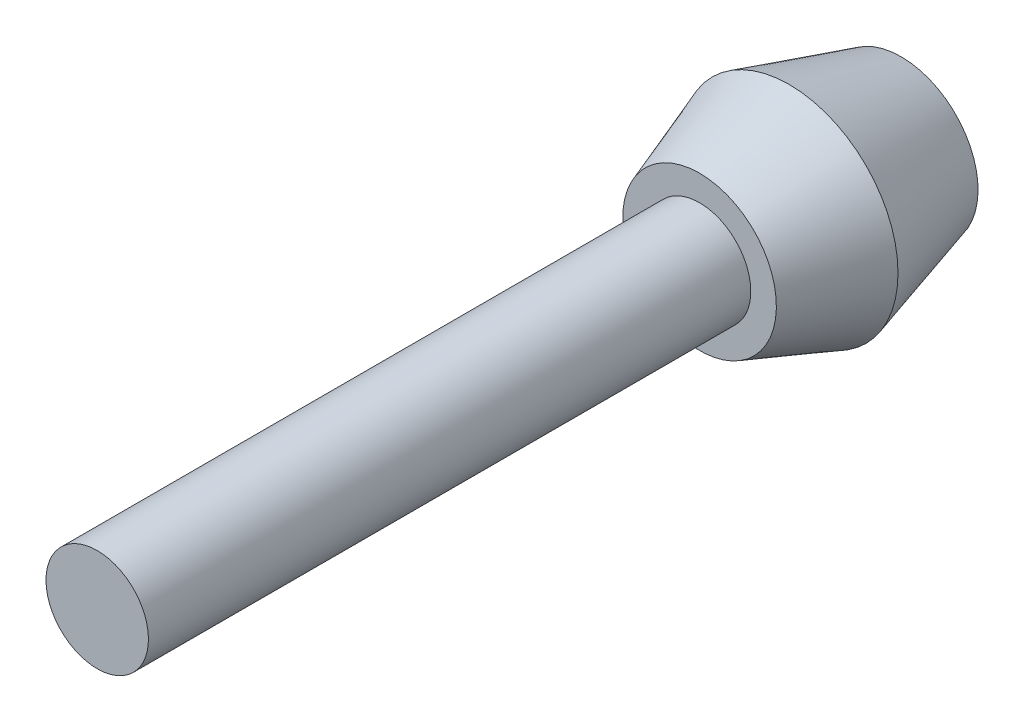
ISO-10303-21;
HEADER;
FILE_DESCRIPTION(('STEP AP214'),'2;1');
FILE_NAME('part.step','',(''),(''),'','','');
FILE_SCHEMA(('AUTOMOTIVE_DESIGN { 1 0 10303 214 1 1 1 1 }'));
ENDSEC;
DATA;
#1=APPLICATION_CONTEXT('core data for automotive mechanical design processes');
#2=APPLICATION_PROTOCOL_DEFINITION('international standard','automotive_design',2000,#1);
#3=PRODUCT_CONTEXT('',#1,'mechanical');
#4=PRODUCT('Part','Part','',(#3));
#5=PRODUCT_RELATED_PRODUCT_CATEGORY('part','',(#4));
#6=PRODUCT_DEFINITION_FORMATION('','',#4);
#7=PRODUCT_DEFINITION_CONTEXT('part definition',#1,'design');
#8=PRODUCT_DEFINITION('design','',#6,#7);
#9=PRODUCT_DEFINITION_SHAPE('','',#8);
#10=(LENGTH_UNIT() NAMED_UNIT(*) SI_UNIT(.MILLI.,.METRE.));
#11=(NAMED_UNIT(*) PLANE_ANGLE_UNIT() SI_UNIT($,.RADIAN.));
#12=(NAMED_UNIT(*) SI_UNIT($,.STERADIAN.) SOLID_ANGLE_UNIT());
#13=UNCERTAINTY_MEASURE_WITH_UNIT(LENGTH_MEASURE(1.E-05),#10,'distance_accuracy_value','');
#14=(GEOMETRIC_REPRESENTATION_CONTEXT(3) GLOBAL_UNCERTAINTY_ASSIGNED_CONTEXT((#13)) GLOBAL_UNIT_ASSIGNED_CONTEXT((#10,
#11,#12)) REPRESENTATION_CONTEXT('',''));
#15=CARTESIAN_POINT('',(0.,0.,0.));
#16=DIRECTION('',(0.,0.,1.));
#17=DIRECTION('',(1.,0.,0.));
#18=AXIS2_PLACEMENT_3D('',#15,#16,#17);
#19=CARTESIAN_POINT('',(0.,0.,62.8));
#20=DIRECTION('',(0.,0.,-1.));
#21=DIRECTION('',(-0.695704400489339,0.718328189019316,0.));
#22=AXIS2_PLACEMENT_3D('',#19,#20,#21);
#23=PLANE('',#22);
#24=CARTESIAN_POINT('',(0.,0.,62.8));
#25=DIRECTION('',(0.,0.,-1.));
#26=DIRECTION('',(0.,1.,0.));
#27=AXIS2_PLACEMENT_3D('',#24,#25,#26);
#28=CIRCLE('',#27,4.);
#29=CARTESIAN_POINT('',(0.,3.99999999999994,62.8));
#30=VERTEX_POINT('',#29);
#31=EDGE_CURVE('E23',#30,#30,#28,.T.);
#32=ORIENTED_EDGE('',*,*,#31,.F.);
#33=EDGE_LOOP('',(#32));
#34=FACE_BOUND('',#33,.T.);
#35=ADVANCED_FACE('F12',(#34),#23,.F.);
#36=CARTESIAN_POINT('',(0.,0.,2.75));
#37=DIRECTION('',(0.,0.,1.));
#38=DIRECTION('',(0.695704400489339,-0.718328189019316,0.));
#39=AXIS2_PLACEMENT_3D('',#36,#37,#38);
#40=CYLINDRICAL_SURFACE('',#39,4.);
#41=CARTESIAN_POINT('',(0.,0.,15.75));
#42=DIRECTION('',(0.,0.,1.));
#43=DIRECTION('',(0.7691072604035,-0.639119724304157,0.));
#44=AXIS2_PLACEMENT_3D('',#41,#42,#43);
#45=CIRCLE('',#44,4.);
#46=CARTESIAN_POINT('',(3.07642904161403,-2.55647889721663,15.75));
#47=VERTEX_POINT('',#46);
#48=EDGE_CURVE('E27',#47,#47,#45,.T.);
#49=ORIENTED_EDGE('',*,*,#48,.T.);
#50=EDGE_LOOP('',(#49));
#51=FACE_BOUND('',#50,.T.);
#52=ORIENTED_EDGE('',*,*,#31,.T.);
#53=EDGE_LOOP('',(#52));
#54=FACE_BOUND('',#53,.T.);
#55=ADVANCED_FACE('F36',(#51,#54),#40,.T.);
#56=CARTESIAN_POINT('',(0.,0.,15.75));
#57=DIRECTION('',(0.,0.,-1.));
#58=DIRECTION('',(-0.7691072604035,0.639119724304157,0.));
#59=AXIS2_PLACEMENT_3D('',#56,#57,#58);
#60=PLANE('',#59);
#61=ORIENTED_EDGE('',*,*,#48,.F.);
#62=EDGE_LOOP('',(#61));
#63=FACE_BOUND('',#62,.T.);
#64=CARTESIAN_POINT('',(0.,0.,15.75));
#65=DIRECTION('',(0.,0.,-1.));
#66=DIRECTION('',(0.,1.,0.));
#67=AXIS2_PLACEMENT_3D('',#64,#65,#66);
#68=CIRCLE('',#67,6.00000000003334);
#69=CARTESIAN_POINT('',(0.,6.00000000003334,15.75));
#70=VERTEX_POINT('',#69);
#71=EDGE_CURVE('E30',#70,#70,#68,.T.);
#72=ORIENTED_EDGE('',*,*,#71,.F.);
#73=EDGE_LOOP('',(#72));
#74=FACE_BOUND('',#73,.T.);
#75=ADVANCED_FACE('F39',(#63,#74),#60,.F.);
#76=CARTESIAN_POINT('',(0.,0.,8.90117658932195));
#77=DIRECTION('',(0.,0.,-1.));
#78=DIRECTION('',(-0.7691072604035,0.639119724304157,0.));
#79=AXIS2_PLACEMENT_3D('',#76,#77,#78);
#80=CONICAL_SURFACE('',#79,8.44600836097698,0.343023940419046);
#81=CARTESIAN_POINT('',(0.,0.,8.75000000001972));
#82=DIRECTION('',(0.,0.,1.));
#83=DIRECTION('',(0.,-1.,0.));
#84=AXIS2_PLACEMENT_3D('',#81,#82,#83);
#85=CIRCLE('',#84,8.50000000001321);
#86=CARTESIAN_POINT('',(0.,-8.50000000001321,8.75000000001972));
#87=VERTEX_POINT('',#86);
#88=EDGE_CURVE('E19',#87,#87,#85,.T.);
#89=ORIENTED_EDGE('',*,*,#88,.T.);
#90=EDGE_LOOP('',(#89));
#91=FACE_BOUND('',#90,.T.);
#92=ORIENTED_EDGE('',*,*,#71,.T.);
#93=EDGE_LOOP('',(#92));
#94=FACE_BOUND('',#93,.T.);
#95=ADVANCED_FACE('F42',(#91,#94),#80,.T.);
#96=CARTESIAN_POINT('',(0.,0.,8.59564782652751));
#97=DIRECTION('',(0.,0.,1.));
#98=DIRECTION('',(0.7691072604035,-0.639119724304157,0.));
#99=AXIS2_PLACEMENT_3D('',#96,#97,#98);
#100=CONICAL_SURFACE('',#99,8.45589937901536,0.278299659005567);
#101=ORIENTED_EDGE('',*,*,#88,.F.);
#102=EDGE_LOOP('',(#101));
#103=FACE_BOUND('',#102,.T.);
#104=CARTESIAN_POINT('',(0.,0.,0.));
#105=DIRECTION('',(0.,0.,-1.));
#106=DIRECTION('',(0.,1.,0.));
#107=AXIS2_PLACEMENT_3D('',#104,#105,#106);
#108=CIRCLE('',#107,6.00000000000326);
#109=CARTESIAN_POINT('',(0.,6.00000000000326,0.));
#110=VERTEX_POINT('',#109);
#111=EDGE_CURVE('E8',#110,#110,#108,.F.);
#112=ORIENTED_EDGE('',*,*,#111,.T.);
#113=EDGE_LOOP('',(#112));
#114=FACE_BOUND('',#113,.T.);
#115=ADVANCED_FACE('F14',(#103,#114),#100,.T.);
#116=CARTESIAN_POINT('',(0.,0.,0.));
#117=DIRECTION('',(0.,0.,-1.));
#118=DIRECTION('',(-0.7691072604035,0.639119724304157,0.));
#119=AXIS2_PLACEMENT_3D('',#116,#117,#118);
#120=PLANE('',#119);
#121=ORIENTED_EDGE('',*,*,#111,.F.);
#122=EDGE_LOOP('',(#121));
#123=FACE_BOUND('',#122,.T.);
#124=ADVANCED_FACE('F52',(#123),#120,.T.);
#125=CLOSED_SHELL('',(#35,#55,#75,#95,#115,#124));
#126=MANIFOLD_SOLID_BREP('B1',#125);
#127=ADVANCED_BREP_SHAPE_REPRESENTATION('',(#18,#126),#14);
#128=SHAPE_DEFINITION_REPRESENTATION(#9,#127);
ENDSEC;
END-ISO-10303-21;
